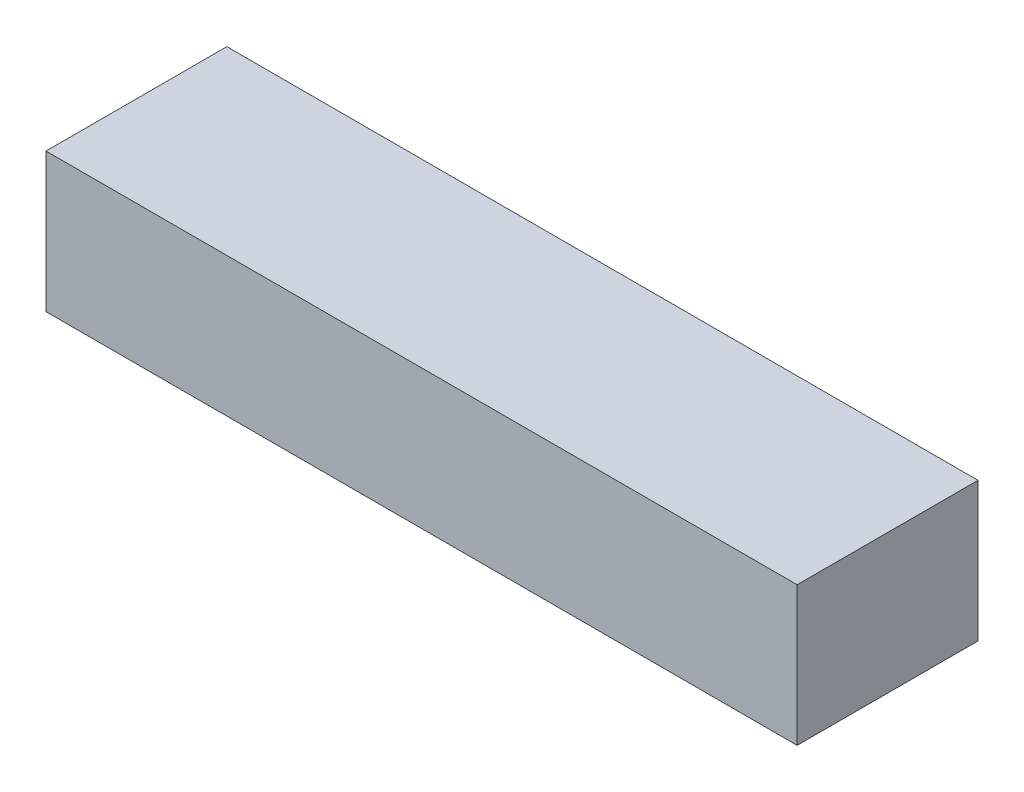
from build123d import *

# Parameters (mm, degrees)
SKETCH1_W           = 270
SKETCH1_H           = 65
BOSS_EXTRUDE1_DEPTH = 50


with BuildPart() as part:
    # Sketch1 → Boss-Extrude1 (new body)
    with BuildSketch(Plane(origin=(0, 0, 0), x_dir=(1, 0, 0), z_dir=(0, 1, 0))):
        with Locations((-15.010060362, -12.092555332)):
            Rectangle(SKETCH1_W, SKETCH1_H)
    extrude(amount=BOSS_EXTRUDE1_DEPTH)


solid = part.part
